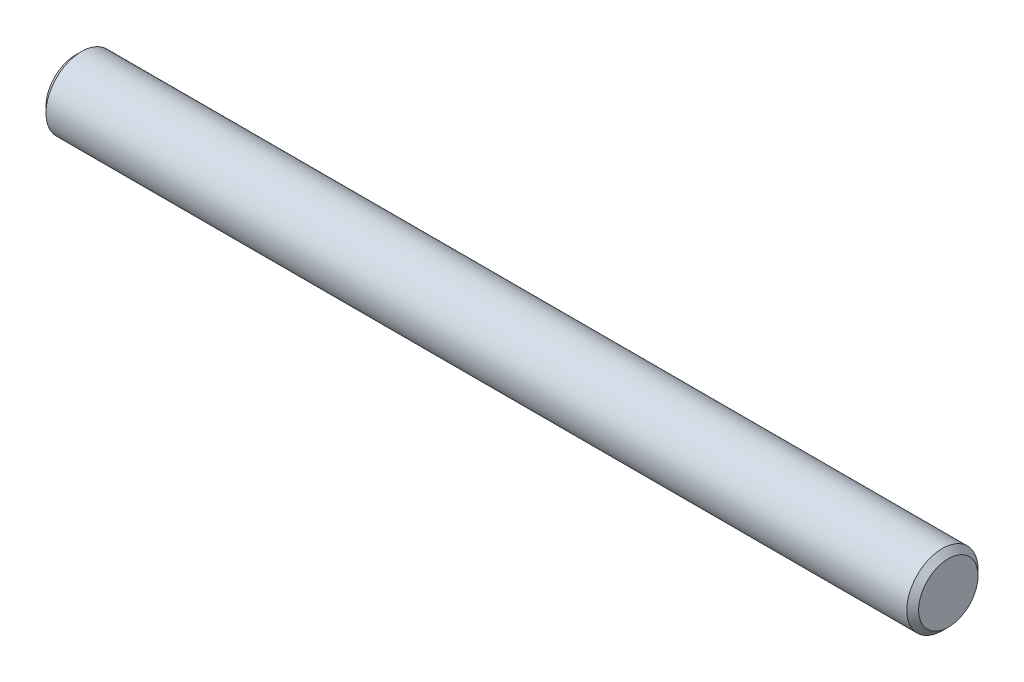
from build123d import *

# Parameters (mm, degrees)
SKETCH1_R      = 6
EXTRUDE1_DEPTH = 147
CHAMFER1_SIZE  = 1


with BuildPart() as part:
    # Sketch1 → Extrude1 (new body)
    with BuildSketch(Plane(origin=(0, 0, 0), x_dir=(0, 0, -1), z_dir=(1, 0, 0))):
        Circle(SKETCH1_R)
    extrude(amount=EXTRUDE1_DEPTH)

    # Chamfer1
    chamfer1_edges = [part.edges().sort_by_distance(p)[0] for p in [
        (0, 0, 6),
        (147, 0, 6),
    ]]
    chamfer(chamfer1_edges, length=CHAMFER1_SIZE)


solid = part.part
